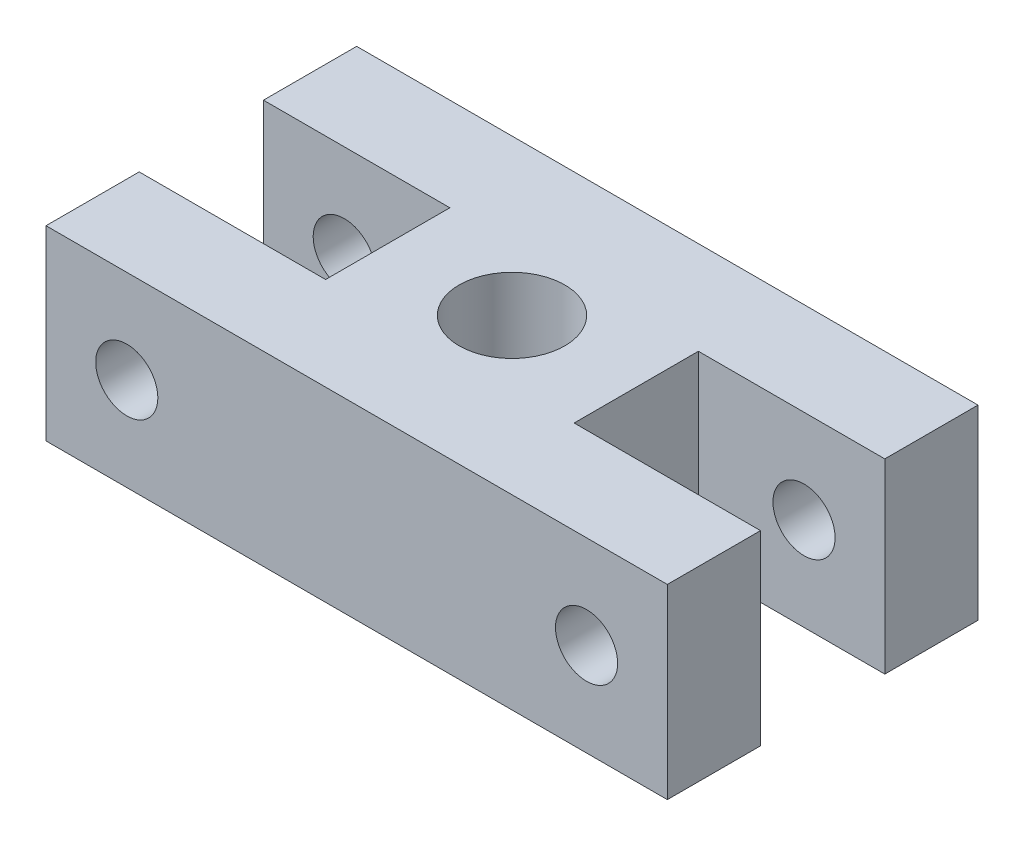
ISO-10303-21;
HEADER;
FILE_DESCRIPTION(('STEP AP214'),'2;1');
FILE_NAME('part.step','',(''),(''),'','','');
FILE_SCHEMA(('AUTOMOTIVE_DESIGN { 1 0 10303 214 1 1 1 1 }'));
ENDSEC;
DATA;
#1=APPLICATION_CONTEXT('core data for automotive mechanical design processes');
#2=APPLICATION_PROTOCOL_DEFINITION('international standard','automotive_design',2000,#1);
#3=PRODUCT_CONTEXT('',#1,'mechanical');
#4=PRODUCT('Part','Part','',(#3));
#5=PRODUCT_RELATED_PRODUCT_CATEGORY('part','',(#4));
#6=PRODUCT_DEFINITION_FORMATION('','',#4);
#7=PRODUCT_DEFINITION_CONTEXT('part definition',#1,'design');
#8=PRODUCT_DEFINITION('design','',#6,#7);
#9=PRODUCT_DEFINITION_SHAPE('','',#8);
#10=(LENGTH_UNIT() NAMED_UNIT(*) SI_UNIT(.MILLI.,.METRE.));
#11=(NAMED_UNIT(*) PLANE_ANGLE_UNIT() SI_UNIT($,.RADIAN.));
#12=(NAMED_UNIT(*) SI_UNIT($,.STERADIAN.) SOLID_ANGLE_UNIT());
#13=UNCERTAINTY_MEASURE_WITH_UNIT(LENGTH_MEASURE(1.E-05),#10,'distance_accuracy_value','');
#14=(GEOMETRIC_REPRESENTATION_CONTEXT(3) GLOBAL_UNCERTAINTY_ASSIGNED_CONTEXT((#13)) GLOBAL_UNIT_ASSIGNED_CONTEXT((#10,
#11,#12)) REPRESENTATION_CONTEXT('',''));
#15=CARTESIAN_POINT('',(0.,0.,0.));
#16=DIRECTION('',(0.,0.,1.));
#17=DIRECTION('',(1.,0.,0.));
#18=AXIS2_PLACEMENT_3D('',#15,#16,#17);
#19=CARTESIAN_POINT('',(25.,-7.5,12.5));
#20=DIRECTION('',(-1.,0.,0.));
#21=DIRECTION('',(0.,0.,1.));
#22=AXIS2_PLACEMENT_3D('',#19,#20,#21);
#23=PLANE('',#22);
#24=DIRECTION('',(0.,0.,-1.));
#25=VECTOR('',#24,1.);
#26=CARTESIAN_POINT('',(25.,7.5,12.5));
#27=LINE('',#26,#25);
#28=CARTESIAN_POINT('',(25.,7.5,-5.));
#29=VERTEX_POINT('',#28);
#30=CARTESIAN_POINT('',(25.,7.5,-12.5));
#31=VERTEX_POINT('',#30);
#32=EDGE_CURVE('E230',#29,#31,#27,.T.);
#33=ORIENTED_EDGE('',*,*,#32,.F.);
#34=DIRECTION('',(0.,1.,0.));
#35=VECTOR('',#34,1.);
#36=CARTESIAN_POINT('',(25.,-7.5,-5.));
#37=LINE('',#36,#35);
#38=CARTESIAN_POINT('',(25.,-7.5,-5.));
#39=VERTEX_POINT('',#38);
#40=EDGE_CURVE('E161',#39,#29,#37,.T.);
#41=ORIENTED_EDGE('',*,*,#40,.F.);
#42=DIRECTION('',(0.,0.,-1.));
#43=VECTOR('',#42,1.);
#44=CARTESIAN_POINT('',(25.,-7.5,12.5));
#45=LINE('',#44,#43);
#46=CARTESIAN_POINT('',(25.,-7.5,-12.5));
#47=VERTEX_POINT('',#46);
#48=EDGE_CURVE('E149',#39,#47,#45,.T.);
#49=ORIENTED_EDGE('',*,*,#48,.T.);
#50=DIRECTION('',(0.,1.,0.));
#51=VECTOR('',#50,1.);
#52=CARTESIAN_POINT('',(25.,-7.5,-12.5));
#53=LINE('',#52,#51);
#54=EDGE_CURVE('E211',#47,#31,#53,.T.);
#55=ORIENTED_EDGE('',*,*,#54,.T.);
#56=EDGE_LOOP('',(#33,#41,#49,#55));
#57=FACE_BOUND('',#56,.T.);
#58=ADVANCED_FACE('F37',(#57),#23,.F.);
#59=CARTESIAN_POINT('',(18.5,0.,-12.5));
#60=DIRECTION('',(0.,0.,1.));
#61=DIRECTION('',(1.,0.,0.));
#62=AXIS2_PLACEMENT_3D('',#59,#60,#61);
#63=CYLINDRICAL_SURFACE('',#62,2.5);
#64=CARTESIAN_POINT('',(18.5,0.,-5.));
#65=DIRECTION('',(0.,0.,-1.));
#66=DIRECTION('',(-1.,0.,0.));
#67=AXIS2_PLACEMENT_3D('',#64,#65,#66);
#68=CIRCLE('',#67,2.5);
#69=CARTESIAN_POINT('',(16.,0.,-5.));
#70=VERTEX_POINT('',#69);
#71=EDGE_CURVE('E41',#70,#70,#68,.F.);
#72=ORIENTED_EDGE('',*,*,#71,.T.);
#73=EDGE_LOOP('',(#72));
#74=FACE_BOUND('',#73,.T.);
#75=CARTESIAN_POINT('',(18.5,0.,-12.5));
#76=DIRECTION('',(0.,0.,1.));
#77=DIRECTION('',(-1.,0.,0.));
#78=AXIS2_PLACEMENT_3D('',#75,#76,#77);
#79=CIRCLE('',#78,2.5);
#80=CARTESIAN_POINT('',(16.,0.,-12.5));
#81=VERTEX_POINT('',#80);
#82=EDGE_CURVE('E196',#81,#81,#79,.T.);
#83=ORIENTED_EDGE('',*,*,#82,.F.);
#84=EDGE_LOOP('',(#83));
#85=FACE_BOUND('',#84,.T.);
#86=ADVANCED_FACE('F246',(#74,#85),#63,.F.);
#87=CARTESIAN_POINT('',(-25.,-7.5,12.5));
#88=DIRECTION('',(1.,0.,0.));
#89=DIRECTION('',(0.,0.,-1.));
#90=AXIS2_PLACEMENT_3D('',#87,#88,#89);
#91=PLANE('',#90);
#92=DIRECTION('',(0.,0.,-1.));
#93=VECTOR('',#92,1.);
#94=CARTESIAN_POINT('',(-25.,-7.5,12.5));
#95=LINE('',#94,#93);
#96=CARTESIAN_POINT('',(-25.,-7.5,-5.));
#97=VERTEX_POINT('',#96);
#98=CARTESIAN_POINT('',(-25.,-7.5,-12.5));
#99=VERTEX_POINT('',#98);
#100=EDGE_CURVE('E46',#97,#99,#95,.T.);
#101=ORIENTED_EDGE('',*,*,#100,.F.);
#102=DIRECTION('',(0.,1.,0.));
#103=VECTOR('',#102,1.);
#104=CARTESIAN_POINT('',(-25.,-7.5,-5.));
#105=LINE('',#104,#103);
#106=CARTESIAN_POINT('',(-25.,7.5,-5.));
#107=VERTEX_POINT('',#106);
#108=EDGE_CURVE('E184',#97,#107,#105,.T.);
#109=ORIENTED_EDGE('',*,*,#108,.T.);
#110=DIRECTION('',(0.,0.,-1.));
#111=VECTOR('',#110,1.);
#112=CARTESIAN_POINT('',(-25.,7.5,12.5));
#113=LINE('',#112,#111);
#114=CARTESIAN_POINT('',(-25.,7.5,-12.5));
#115=VERTEX_POINT('',#114);
#116=EDGE_CURVE('E226',#107,#115,#113,.T.);
#117=ORIENTED_EDGE('',*,*,#116,.T.);
#118=DIRECTION('',(0.,-1.,0.));
#119=VECTOR('',#118,1.);
#120=CARTESIAN_POINT('',(-25.,-7.5,-12.5));
#121=LINE('',#120,#119);
#122=EDGE_CURVE('E206',#115,#99,#121,.T.);
#123=ORIENTED_EDGE('',*,*,#122,.T.);
#124=EDGE_LOOP('',(#101,#109,#117,#123));
#125=FACE_BOUND('',#124,.T.);
#126=ADVANCED_FACE('F270',(#125),#91,.F.);
#127=CARTESIAN_POINT('',(-18.5,0.,-12.5));
#128=DIRECTION('',(0.,0.,1.));
#129=DIRECTION('',(1.,0.,0.));
#130=AXIS2_PLACEMENT_3D('',#127,#128,#129);
#131=CYLINDRICAL_SURFACE('',#130,2.5);
#132=CARTESIAN_POINT('',(-18.5,0.,-5.));
#133=DIRECTION('',(0.,0.,-1.));
#134=DIRECTION('',(-1.,0.,0.));
#135=AXIS2_PLACEMENT_3D('',#132,#133,#134);
#136=CIRCLE('',#135,2.5);
#137=CARTESIAN_POINT('',(-21.,0.,-5.));
#138=VERTEX_POINT('',#137);
#139=EDGE_CURVE('E197',#138,#138,#136,.F.);
#140=ORIENTED_EDGE('',*,*,#139,.T.);
#141=EDGE_LOOP('',(#140));
#142=FACE_BOUND('',#141,.T.);
#143=CARTESIAN_POINT('',(-18.5,0.,-12.5));
#144=DIRECTION('',(0.,0.,1.));
#145=DIRECTION('',(1.,0.,0.));
#146=AXIS2_PLACEMENT_3D('',#143,#144,#145);
#147=CIRCLE('',#146,2.5);
#148=CARTESIAN_POINT('',(-16.,0.,-12.5));
#149=VERTEX_POINT('',#148);
#150=EDGE_CURVE('E203',#149,#149,#147,.T.);
#151=ORIENTED_EDGE('',*,*,#150,.F.);
#152=EDGE_LOOP('',(#151));
#153=FACE_BOUND('',#152,.T.);
#154=ADVANCED_FACE('F324',(#142,#153),#131,.F.);
#155=CARTESIAN_POINT('',(-25.,7.5,12.5));
#156=VERTEX_POINT('',#155);
#157=CARTESIAN_POINT('',(-25.,7.5,5.));
#158=VERTEX_POINT('',#157);
#159=EDGE_CURVE('E227',#156,#158,#113,.T.);
#160=ORIENTED_EDGE('',*,*,#159,.T.);
#161=DIRECTION('',(0.,1.,0.));
#162=VECTOR('',#161,1.);
#163=CARTESIAN_POINT('',(-25.,-7.5,5.));
#164=LINE('',#163,#162);
#165=CARTESIAN_POINT('',(-25.,-7.5,5.));
#166=VERTEX_POINT('',#165);
#167=EDGE_CURVE('E62',#166,#158,#164,.T.);
#168=ORIENTED_EDGE('',*,*,#167,.F.);
#169=CARTESIAN_POINT('',(-25.,-7.5,12.5));
#170=VERTEX_POINT('',#169);
#171=EDGE_CURVE('E11',#170,#166,#95,.T.);
#172=ORIENTED_EDGE('',*,*,#171,.F.);
#173=DIRECTION('',(0.,-1.,0.));
#174=VECTOR('',#173,1.);
#175=CARTESIAN_POINT('',(-25.,-7.5,12.5));
#176=LINE('',#175,#174);
#177=EDGE_CURVE('E217',#156,#170,#176,.T.);
#178=ORIENTED_EDGE('',*,*,#177,.F.);
#179=EDGE_LOOP('',(#160,#168,#172,#178));
#180=FACE_BOUND('',#179,.T.);
#181=ADVANCED_FACE('F39',(#180),#91,.F.);
#182=CARTESIAN_POINT('',(-25.,-7.5,12.5));
#183=DIRECTION('',(0.,1.,0.));
#184=DIRECTION('',(0.,0.,1.));
#185=AXIS2_PLACEMENT_3D('',#182,#183,#184);
#186=PLANE('',#185);
#187=CARTESIAN_POINT('',(0.,-7.5,0.));
#188=DIRECTION('',(0.,1.,0.));
#189=DIRECTION('',(0.,0.,1.));
#190=AXIS2_PLACEMENT_3D('',#187,#188,#189);
#191=CIRCLE('',#190,4.25);
#192=CARTESIAN_POINT('',(0.,-7.5,4.25));
#193=VERTEX_POINT('',#192);
#194=EDGE_CURVE('E396',#193,#193,#191,.T.);
#195=ORIENTED_EDGE('',*,*,#194,.T.);
#196=EDGE_LOOP('',(#195));
#197=FACE_BOUND('',#196,.T.);
#198=ORIENTED_EDGE('',*,*,#48,.F.);
#199=DIRECTION('',(-1.,0.,0.));
#200=VECTOR('',#199,1.);
#201=CARTESIAN_POINT('',(25.,-7.5,-5.));
#202=LINE('',#201,#200);
#203=CARTESIAN_POINT('',(10.,-7.5,-5.));
#204=VERTEX_POINT('',#203);
#205=EDGE_CURVE('E131',#39,#204,#202,.T.);
#206=ORIENTED_EDGE('',*,*,#205,.T.);
#207=DIRECTION('',(0.,0.,1.));
#208=VECTOR('',#207,1.);
#209=CARTESIAN_POINT('',(10.,-7.5,-5.));
#210=LINE('',#209,#208);
#211=CARTESIAN_POINT('',(10.,-7.5,5.));
#212=VERTEX_POINT('',#211);
#213=EDGE_CURVE('E140',#204,#212,#210,.T.);
#214=ORIENTED_EDGE('',*,*,#213,.T.);
#215=DIRECTION('',(1.,0.,0.));
#216=VECTOR('',#215,1.);
#217=CARTESIAN_POINT('',(25.,-7.5,5.));
#218=LINE('',#217,#216);
#219=CARTESIAN_POINT('',(25.,-7.5,5.));
#220=VERTEX_POINT('',#219);
#221=EDGE_CURVE('E137',#212,#220,#218,.T.);
#222=ORIENTED_EDGE('',*,*,#221,.T.);
#223=CARTESIAN_POINT('',(25.,-7.5,12.5));
#224=VERTEX_POINT('',#223);
#225=EDGE_CURVE('E234',#224,#220,#45,.T.);
#226=ORIENTED_EDGE('',*,*,#225,.F.);
#227=DIRECTION('',(1.,0.,0.));
#228=VECTOR('',#227,1.);
#229=CARTESIAN_POINT('',(-25.,-7.5,12.5));
#230=LINE('',#229,#228);
#231=EDGE_CURVE('E220',#170,#224,#230,.T.);
#232=ORIENTED_EDGE('',*,*,#231,.F.);
#233=ORIENTED_EDGE('',*,*,#171,.T.);
#234=DIRECTION('',(1.,0.,0.));
#235=VECTOR('',#234,1.);
#236=CARTESIAN_POINT('',(-25.,-7.5,5.));
#237=LINE('',#236,#235);
#238=CARTESIAN_POINT('',(-10.,-7.5,5.));
#239=VERTEX_POINT('',#238);
#240=EDGE_CURVE('E168',#166,#239,#237,.T.);
#241=ORIENTED_EDGE('',*,*,#240,.T.);
#242=DIRECTION('',(0.,0.,-1.));
#243=VECTOR('',#242,1.);
#244=CARTESIAN_POINT('',(-10.,-7.5,-5.));
#245=LINE('',#244,#243);
#246=CARTESIAN_POINT('',(-10.,-7.5,-5.));
#247=VERTEX_POINT('',#246);
#248=EDGE_CURVE('E171',#239,#247,#245,.T.);
#249=ORIENTED_EDGE('',*,*,#248,.T.);
#250=DIRECTION('',(-1.,0.,0.));
#251=VECTOR('',#250,1.);
#252=CARTESIAN_POINT('',(-25.,-7.5,-5.));
#253=LINE('',#252,#251);
#254=EDGE_CURVE('E175',#247,#97,#253,.T.);
#255=ORIENTED_EDGE('',*,*,#254,.T.);
#256=ORIENTED_EDGE('',*,*,#100,.T.);
#257=DIRECTION('',(1.,0.,0.));
#258=VECTOR('',#257,1.);
#259=CARTESIAN_POINT('',(-25.,-7.5,-12.5));
#260=LINE('',#259,#258);
#261=EDGE_CURVE('E209',#99,#47,#260,.T.);
#262=ORIENTED_EDGE('',*,*,#261,.T.);
#263=EDGE_LOOP('',(#198,#206,#214,#222,#226,#232,#233,#241,#249,#255,#256,#262));
#264=FACE_BOUND('',#263,.T.);
#265=ADVANCED_FACE('F147',(#197,#264),#186,.F.);
#266=ORIENTED_EDGE('',*,*,#225,.T.);
#267=DIRECTION('',(0.,1.,0.));
#268=VECTOR('',#267,1.);
#269=CARTESIAN_POINT('',(25.,-7.5,5.));
#270=LINE('',#269,#268);
#271=CARTESIAN_POINT('',(25.,7.5,5.));
#272=VERTEX_POINT('',#271);
#273=EDGE_CURVE('E164',#220,#272,#270,.T.);
#274=ORIENTED_EDGE('',*,*,#273,.T.);
#275=CARTESIAN_POINT('',(25.,7.5,12.5));
#276=VERTEX_POINT('',#275);
#277=EDGE_CURVE('E231',#276,#272,#27,.T.);
#278=ORIENTED_EDGE('',*,*,#277,.F.);
#279=DIRECTION('',(0.,1.,0.));
#280=VECTOR('',#279,1.);
#281=CARTESIAN_POINT('',(25.,-7.5,12.5));
#282=LINE('',#281,#280);
#283=EDGE_CURVE('E222',#224,#276,#282,.T.);
#284=ORIENTED_EDGE('',*,*,#283,.F.);
#285=EDGE_LOOP('',(#266,#274,#278,#284));
#286=FACE_BOUND('',#285,.T.);
#287=ADVANCED_FACE('F266',(#286),#23,.F.);
#288=CARTESIAN_POINT('',(-25.,7.5,12.5));
#289=DIRECTION('',(0.,-1.,0.));
#290=DIRECTION('',(0.,0.,-1.));
#291=AXIS2_PLACEMENT_3D('',#288,#289,#290);
#292=PLANE('',#291);
#293=CARTESIAN_POINT('',(0.,7.5,0.));
#294=DIRECTION('',(0.,1.,0.));
#295=DIRECTION('',(0.,0.,1.));
#296=AXIS2_PLACEMENT_3D('',#293,#294,#295);
#297=CIRCLE('',#296,4.24999999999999);
#298=CARTESIAN_POINT('',(0.,7.5,4.24999999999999));
#299=VERTEX_POINT('',#298);
#300=EDGE_CURVE('E155',#299,#299,#297,.T.);
#301=ORIENTED_EDGE('',*,*,#300,.F.);
#302=EDGE_LOOP('',(#301));
#303=FACE_BOUND('',#302,.T.);
#304=DIRECTION('',(0.,0.,1.));
#305=VECTOR('',#304,1.);
#306=CARTESIAN_POINT('',(10.,7.5,-5.));
#307=LINE('',#306,#305);
#308=CARTESIAN_POINT('',(10.,7.5,-5.));
#309=VERTEX_POINT('',#308);
#310=CARTESIAN_POINT('',(10.,7.5,5.));
#311=VERTEX_POINT('',#310);
#312=EDGE_CURVE('E152',#309,#311,#307,.T.);
#313=ORIENTED_EDGE('',*,*,#312,.F.);
#314=DIRECTION('',(-1.,0.,0.));
#315=VECTOR('',#314,1.);
#316=CARTESIAN_POINT('',(25.,7.5,-5.));
#317=LINE('',#316,#315);
#318=EDGE_CURVE('E54',#29,#309,#317,.T.);
#319=ORIENTED_EDGE('',*,*,#318,.F.);
#320=ORIENTED_EDGE('',*,*,#32,.T.);
#321=DIRECTION('',(-1.,0.,0.));
#322=VECTOR('',#321,1.);
#323=CARTESIAN_POINT('',(-25.,7.5,-12.5));
#324=LINE('',#323,#322);
#325=EDGE_CURVE('E214',#31,#115,#324,.T.);
#326=ORIENTED_EDGE('',*,*,#325,.T.);
#327=ORIENTED_EDGE('',*,*,#116,.F.);
#328=DIRECTION('',(-1.,0.,0.));
#329=VECTOR('',#328,1.);
#330=CARTESIAN_POINT('',(-25.,7.5,-5.));
#331=LINE('',#330,#329);
#332=CARTESIAN_POINT('',(-10.,7.5,-5.));
#333=VERTEX_POINT('',#332);
#334=EDGE_CURVE('E172',#333,#107,#331,.T.);
#335=ORIENTED_EDGE('',*,*,#334,.F.);
#336=DIRECTION('',(0.,0.,-1.));
#337=VECTOR('',#336,1.);
#338=CARTESIAN_POINT('',(-10.,7.5,-5.));
#339=LINE('',#338,#337);
#340=CARTESIAN_POINT('',(-10.,7.5,5.));
#341=VERTEX_POINT('',#340);
#342=EDGE_CURVE('E180',#341,#333,#339,.T.);
#343=ORIENTED_EDGE('',*,*,#342,.F.);
#344=DIRECTION('',(1.,0.,0.));
#345=VECTOR('',#344,1.);
#346=CARTESIAN_POINT('',(-25.,7.5,5.));
#347=LINE('',#346,#345);
#348=EDGE_CURVE('E178',#158,#341,#347,.T.);
#349=ORIENTED_EDGE('',*,*,#348,.F.);
#350=ORIENTED_EDGE('',*,*,#159,.F.);
#351=DIRECTION('',(-1.,0.,0.));
#352=VECTOR('',#351,1.);
#353=CARTESIAN_POINT('',(-25.,7.5,12.5));
#354=LINE('',#353,#352);
#355=EDGE_CURVE('E224',#276,#156,#354,.T.);
#356=ORIENTED_EDGE('',*,*,#355,.F.);
#357=ORIENTED_EDGE('',*,*,#277,.T.);
#358=DIRECTION('',(1.,0.,0.));
#359=VECTOR('',#358,1.);
#360=CARTESIAN_POINT('',(25.,7.5,5.));
#361=LINE('',#360,#359);
#362=EDGE_CURVE('E150',#311,#272,#361,.T.);
#363=ORIENTED_EDGE('',*,*,#362,.F.);
#364=EDGE_LOOP('',(#313,#319,#320,#326,#327,#335,#343,#349,#350,#356,#357,#363));
#365=FACE_BOUND('',#364,.T.);
#366=ADVANCED_FACE('F276',(#303,#365),#292,.F.);
#367=CARTESIAN_POINT('',(-25.,7.5,12.5));
#368=DIRECTION('',(0.,0.,-1.));
#369=DIRECTION('',(-1.,0.,0.));
#370=AXIS2_PLACEMENT_3D('',#367,#368,#369);
#371=PLANE('',#370);
#372=CARTESIAN_POINT('',(18.5,0.,12.5));
#373=DIRECTION('',(0.,0.,1.));
#374=DIRECTION('',(-1.,0.,0.));
#375=AXIS2_PLACEMENT_3D('',#372,#373,#374);
#376=CIRCLE('',#375,2.5);
#377=CARTESIAN_POINT('',(16.,0.,12.5));
#378=VERTEX_POINT('',#377);
#379=EDGE_CURVE('E193',#378,#378,#376,.T.);
#380=ORIENTED_EDGE('',*,*,#379,.F.);
#381=EDGE_LOOP('',(#380));
#382=FACE_BOUND('',#381,.T.);
#383=CARTESIAN_POINT('',(-18.5,0.,12.5));
#384=DIRECTION('',(0.,0.,1.));
#385=DIRECTION('',(1.,0.,0.));
#386=AXIS2_PLACEMENT_3D('',#383,#384,#385);
#387=CIRCLE('',#386,2.5);
#388=CARTESIAN_POINT('',(-16.,0.,12.5));
#389=VERTEX_POINT('',#388);
#390=EDGE_CURVE('E200',#389,#389,#387,.T.);
#391=ORIENTED_EDGE('',*,*,#390,.F.);
#392=EDGE_LOOP('',(#391));
#393=FACE_BOUND('',#392,.T.);
#394=ORIENTED_EDGE('',*,*,#177,.T.);
#395=ORIENTED_EDGE('',*,*,#231,.T.);
#396=ORIENTED_EDGE('',*,*,#283,.T.);
#397=ORIENTED_EDGE('',*,*,#355,.T.);
#398=EDGE_LOOP('',(#394,#395,#396,#397));
#399=FACE_BOUND('',#398,.T.);
#400=ADVANCED_FACE('F282',(#382,#393,#399),#371,.F.);
#401=CARTESIAN_POINT('',(-25.,7.5,-12.5));
#402=DIRECTION('',(0.,0.,-1.));
#403=DIRECTION('',(-1.,0.,0.));
#404=AXIS2_PLACEMENT_3D('',#401,#402,#403);
#405=PLANE('',#404);
#406=ORIENTED_EDGE('',*,*,#82,.T.);
#407=EDGE_LOOP('',(#406));
#408=FACE_BOUND('',#407,.T.);
#409=ORIENTED_EDGE('',*,*,#150,.T.);
#410=EDGE_LOOP('',(#409));
#411=FACE_BOUND('',#410,.T.);
#412=ORIENTED_EDGE('',*,*,#122,.F.);
#413=ORIENTED_EDGE('',*,*,#325,.F.);
#414=ORIENTED_EDGE('',*,*,#54,.F.);
#415=ORIENTED_EDGE('',*,*,#261,.F.);
#416=EDGE_LOOP('',(#412,#413,#414,#415));
#417=FACE_BOUND('',#416,.T.);
#418=ADVANCED_FACE('F312',(#408,#411,#417),#405,.T.);
#419=CARTESIAN_POINT('',(-18.5,0.,5.));
#420=DIRECTION('',(0.,0.,1.));
#421=DIRECTION('',(1.,0.,0.));
#422=AXIS2_PLACEMENT_3D('',#419,#420,#421);
#423=CIRCLE('',#422,2.5);
#424=CARTESIAN_POINT('',(-16.,0.,5.));
#425=VERTEX_POINT('',#424);
#426=EDGE_CURVE('E187',#425,#425,#423,.F.);
#427=ORIENTED_EDGE('',*,*,#426,.T.);
#428=EDGE_LOOP('',(#427));
#429=FACE_BOUND('',#428,.T.);
#430=ORIENTED_EDGE('',*,*,#390,.T.);
#431=EDGE_LOOP('',(#430));
#432=FACE_BOUND('',#431,.T.);
#433=ADVANCED_FACE('F315',(#429,#432),#131,.F.);
#434=CARTESIAN_POINT('',(18.5,0.,5.));
#435=DIRECTION('',(0.,0.,1.));
#436=DIRECTION('',(1.,0.,0.));
#437=AXIS2_PLACEMENT_3D('',#434,#435,#436);
#438=CIRCLE('',#437,2.5);
#439=CARTESIAN_POINT('',(21.,0.,5.));
#440=VERTEX_POINT('',#439);
#441=EDGE_CURVE('E163',#440,#440,#438,.F.);
#442=ORIENTED_EDGE('',*,*,#441,.T.);
#443=EDGE_LOOP('',(#442));
#444=FACE_BOUND('',#443,.T.);
#445=ORIENTED_EDGE('',*,*,#379,.T.);
#446=EDGE_LOOP('',(#445));
#447=FACE_BOUND('',#446,.T.);
#448=ADVANCED_FACE('F272',(#444,#447),#63,.F.);
#449=CARTESIAN_POINT('',(-25.,-7.5,-5.));
#450=DIRECTION('',(0.,0.,-1.));
#451=DIRECTION('',(-1.,0.,0.));
#452=AXIS2_PLACEMENT_3D('',#449,#450,#451);
#453=PLANE('',#452);
#454=ORIENTED_EDGE('',*,*,#334,.T.);
#455=ORIENTED_EDGE('',*,*,#108,.F.);
#456=ORIENTED_EDGE('',*,*,#254,.F.);
#457=DIRECTION('',(0.,1.,0.));
#458=VECTOR('',#457,1.);
#459=CARTESIAN_POINT('',(-10.,-7.5,-5.));
#460=LINE('',#459,#458);
#461=EDGE_CURVE('E188',#247,#333,#460,.T.);
#462=ORIENTED_EDGE('',*,*,#461,.T.);
#463=EDGE_LOOP('',(#454,#455,#456,#462));
#464=FACE_BOUND('',#463,.T.);
#465=ORIENTED_EDGE('',*,*,#139,.F.);
#466=EDGE_LOOP('',(#465));
#467=FACE_BOUND('',#466,.T.);
#468=ADVANCED_FACE('F303',(#464,#467),#453,.F.);
#469=CARTESIAN_POINT('',(-25.,-7.5,5.));
#470=DIRECTION('',(0.,0.,1.));
#471=DIRECTION('',(1.,0.,0.));
#472=AXIS2_PLACEMENT_3D('',#469,#470,#471);
#473=PLANE('',#472);
#474=ORIENTED_EDGE('',*,*,#348,.T.);
#475=DIRECTION('',(0.,1.,0.));
#476=VECTOR('',#475,1.);
#477=CARTESIAN_POINT('',(-10.,-7.5,5.));
#478=LINE('',#477,#476);
#479=EDGE_CURVE('E190',#239,#341,#478,.T.);
#480=ORIENTED_EDGE('',*,*,#479,.F.);
#481=ORIENTED_EDGE('',*,*,#240,.F.);
#482=ORIENTED_EDGE('',*,*,#167,.T.);
#483=EDGE_LOOP('',(#474,#480,#481,#482));
#484=FACE_BOUND('',#483,.T.);
#485=ORIENTED_EDGE('',*,*,#426,.F.);
#486=EDGE_LOOP('',(#485));
#487=FACE_BOUND('',#486,.T.);
#488=ADVANCED_FACE('F258',(#484,#487),#473,.F.);
#489=CARTESIAN_POINT('',(-10.,-7.5,-5.));
#490=DIRECTION('',(1.,0.,0.));
#491=DIRECTION('',(0.,0.,-1.));
#492=AXIS2_PLACEMENT_3D('',#489,#490,#491);
#493=PLANE('',#492);
#494=ORIENTED_EDGE('',*,*,#342,.T.);
#495=ORIENTED_EDGE('',*,*,#461,.F.);
#496=ORIENTED_EDGE('',*,*,#248,.F.);
#497=ORIENTED_EDGE('',*,*,#479,.T.);
#498=EDGE_LOOP('',(#494,#495,#496,#497));
#499=FACE_BOUND('',#498,.T.);
#500=ADVANCED_FACE('F250',(#499),#493,.F.);
#501=CARTESIAN_POINT('',(25.,-7.5,-5.));
#502=DIRECTION('',(0.,0.,-1.));
#503=DIRECTION('',(-1.,0.,0.));
#504=AXIS2_PLACEMENT_3D('',#501,#502,#503);
#505=PLANE('',#504);
#506=ORIENTED_EDGE('',*,*,#318,.T.);
#507=DIRECTION('',(0.,1.,0.));
#508=VECTOR('',#507,1.);
#509=CARTESIAN_POINT('',(10.,-7.5,-5.));
#510=LINE('',#509,#508);
#511=EDGE_CURVE('E126',#204,#309,#510,.T.);
#512=ORIENTED_EDGE('',*,*,#511,.F.);
#513=ORIENTED_EDGE('',*,*,#205,.F.);
#514=ORIENTED_EDGE('',*,*,#40,.T.);
#515=EDGE_LOOP('',(#506,#512,#513,#514));
#516=FACE_BOUND('',#515,.T.);
#517=ORIENTED_EDGE('',*,*,#71,.F.);
#518=EDGE_LOOP('',(#517));
#519=FACE_BOUND('',#518,.T.);
#520=ADVANCED_FACE('F128',(#516,#519),#505,.F.);
#521=CARTESIAN_POINT('',(25.,-7.5,5.));
#522=DIRECTION('',(0.,0.,1.));
#523=DIRECTION('',(1.,0.,0.));
#524=AXIS2_PLACEMENT_3D('',#521,#522,#523);
#525=PLANE('',#524);
#526=ORIENTED_EDGE('',*,*,#362,.T.);
#527=ORIENTED_EDGE('',*,*,#273,.F.);
#528=ORIENTED_EDGE('',*,*,#221,.F.);
#529=DIRECTION('',(0.,1.,0.));
#530=VECTOR('',#529,1.);
#531=CARTESIAN_POINT('',(10.,-7.5,5.));
#532=LINE('',#531,#530);
#533=EDGE_CURVE('E136',#212,#311,#532,.T.);
#534=ORIENTED_EDGE('',*,*,#533,.T.);
#535=EDGE_LOOP('',(#526,#527,#528,#534));
#536=FACE_BOUND('',#535,.T.);
#537=ORIENTED_EDGE('',*,*,#441,.F.);
#538=EDGE_LOOP('',(#537));
#539=FACE_BOUND('',#538,.T.);
#540=ADVANCED_FACE('F249',(#536,#539),#525,.F.);
#541=CARTESIAN_POINT('',(10.,-7.5,-5.));
#542=DIRECTION('',(-1.,0.,0.));
#543=DIRECTION('',(0.,0.,1.));
#544=AXIS2_PLACEMENT_3D('',#541,#542,#543);
#545=PLANE('',#544);
#546=ORIENTED_EDGE('',*,*,#312,.T.);
#547=ORIENTED_EDGE('',*,*,#533,.F.);
#548=ORIENTED_EDGE('',*,*,#213,.F.);
#549=ORIENTED_EDGE('',*,*,#511,.T.);
#550=EDGE_LOOP('',(#546,#547,#548,#549));
#551=FACE_BOUND('',#550,.T.);
#552=ADVANCED_FACE('F141',(#551),#545,.F.);
#553=CARTESIAN_POINT('',(0.,7.5,0.));
#554=DIRECTION('',(0.,1.,0.));
#555=DIRECTION('',(0.,0.,1.));
#556=AXIS2_PLACEMENT_3D('',#553,#554,#555);
#557=CYLINDRICAL_SURFACE('',#556,4.24999999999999);
#558=ORIENTED_EDGE('',*,*,#194,.F.);
#559=EDGE_LOOP('',(#558));
#560=FACE_BOUND('',#559,.T.);
#561=ORIENTED_EDGE('',*,*,#300,.T.);
#562=EDGE_LOOP('',(#561));
#563=FACE_BOUND('',#562,.T.);
#564=ADVANCED_FACE('F363',(#560,#563),#557,.F.);
#565=CLOSED_SHELL('',(#58,#86,#126,#154,#181,#265,#287,#366,#400,#418,#433,#448,#468,#488,#500,
#520,#540,#552,#564));
#566=MANIFOLD_SOLID_BREP('B2',#565);
#567=ADVANCED_BREP_SHAPE_REPRESENTATION('',(#18,#566),#14);
#568=SHAPE_DEFINITION_REPRESENTATION(#9,#567);
ENDSEC;
END-ISO-10303-21;
